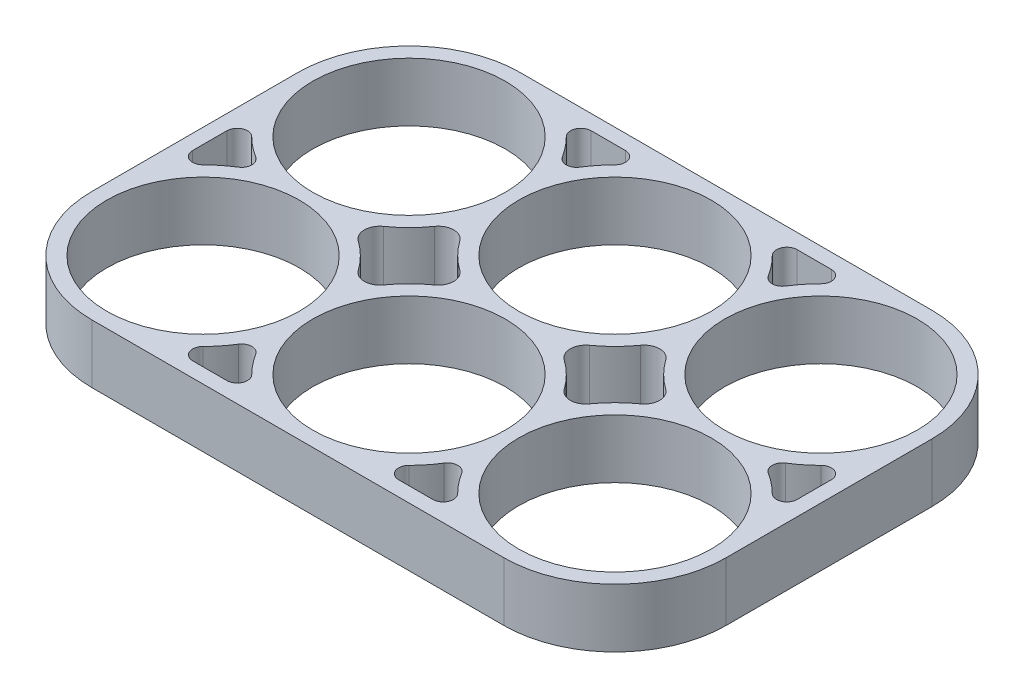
from build123d import *

# Parameters (mm, degrees)
SKIZZE1_R                       = 9.35
AUFSATZ_LINEAR_AUSTRAGEN1_DEPTH = 5.7


with BuildPart() as part:
    # Skizze1 → Aufsatz-Linear austragen1 (new body)
    with BuildSketch(Plane(origin=(0, 0, 0), x_dir=(1, 0, 0), z_dir=(0, 1, 0))):
        with BuildLine():
            Line((-30.8, 10), (-30.8, -10))
            ThreePointArc((-30.8, -10), (-27.636753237, -17.636753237), (-20, -20.8))
            Line((-20, -20.8), (20, -20.8))
            ThreePointArc((20, -20.8), (27.636753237, -17.636753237), (30.8, -10))
            Line((30.8, -10), (30.8, 10))
            ThreePointArc((30.8, 10), (27.636753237, 17.636753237), (20, 20.8))
            Line((20, 20.8), (-20, 20.8))
            ThreePointArc((-20, 20.8), (-27.636753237, 17.636753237), (-30.8, 10))
        make_face()
        with Locations(Location((-20, -10, 0), (0, 0, 270))):
            Circle(SKIZZE1_R, mode=Mode.SUBTRACT)
        with Locations(Location((0, -10, 0), (0, 0, 270))):
            Circle(SKIZZE1_R, mode=Mode.SUBTRACT)
        with Locations(Location((20, -10, 0), (0, 0, 270))):
            Circle(SKIZZE1_R, mode=Mode.SUBTRACT)
        with Locations(Location((20, 10, 0), (0, 0, 270))):
            Circle(SKIZZE1_R, mode=Mode.SUBTRACT)
        with Locations(Location((0, 10, 0), (0, 0, 270))):
            Circle(SKIZZE1_R, mode=Mode.SUBTRACT)
        with Locations(Location((-20, 10, 0), (0, 0, 270))):
            Circle(SKIZZE1_R, mode=Mode.SUBTRACT)
        with BuildLine():
            Line((-29.35, 1.662284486), (-29.35, -1.662284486))
            ThreePointArc((-29.35, -1.662284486), (-28.732343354, -2.58630481), (-27.642372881, -2.368870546))
            ThreePointArc((-27.642372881, -2.368870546), (-26.730970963, -1.554052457), (-25.733320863, -0.847457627))
            ThreePointArc((-25.733320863, -0.847457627), (-25.264183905, 0), (-25.733320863, 0.847457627))
            ThreePointArc((-25.733320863, 0.847457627), (-26.730970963, 1.554052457), (-27.642372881, 2.368870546))
            ThreePointArc((-27.642372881, 2.368870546), (-28.732343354, 2.58630481), (-29.35, 1.662284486))
        make_face(mode=Mode.SUBTRACT)
        with BuildLine():
            Line((-11.662284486, -19.35), (-8.337715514, -19.35))
            ThreePointArc((-8.337715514, -19.35), (-7.41369519, -18.732343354), (-7.631129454, -17.642372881))
            ThreePointArc((-7.631129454, -17.642372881), (-8.445947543, -16.730970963), (-9.152542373, -15.733320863))
            ThreePointArc((-9.152542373, -15.733320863), (-10, -15.264183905), (-10.847457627, -15.733320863))
            ThreePointArc((-10.847457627, -15.733320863), (-11.554052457, -16.730970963), (-12.368870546, -17.642372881))
            ThreePointArc((-12.368870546, -17.642372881), (-12.58630481, -18.732343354), (-11.662284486, -19.35))
        make_face(mode=Mode.SUBTRACT)
        with BuildLine():
            Line((8.337715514, -19.35), (11.662284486, -19.35))
            ThreePointArc((11.662284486, -19.35), (12.58630481, -18.732343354), (12.368870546, -17.642372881))
            ThreePointArc((12.368870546, -17.642372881), (11.554052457, -16.730970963), (10.847457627, -15.733320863))
            ThreePointArc((10.847457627, -15.733320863), (10, -15.264183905), (9.152542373, -15.733320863))
            ThreePointArc((9.152542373, -15.733320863), (8.445947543, -16.730970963), (7.631129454, -17.642372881))
            ThreePointArc((7.631129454, -17.642372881), (7.41369519, -18.732343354), (8.337715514, -19.35))
        make_face(mode=Mode.SUBTRACT)
        with BuildLine():
            Line((29.35, 1.662284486), (29.35, -1.662284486))
            ThreePointArc((29.35, -1.662284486), (28.732343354, -2.58630481), (27.642372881, -2.368870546))
            ThreePointArc((27.642372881, -2.368870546), (26.730970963, -1.554052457), (25.733320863, -0.847457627))
            ThreePointArc((25.733320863, -0.847457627), (25.264183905, 0), (25.733320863, 0.847457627))
            ThreePointArc((25.733320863, 0.847457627), (26.730970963, 1.554052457), (27.642372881, 2.368870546))
            ThreePointArc((27.642372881, 2.368870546), (28.732343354, 2.58630481), (29.35, 1.662284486))
        make_face(mode=Mode.SUBTRACT)
        with BuildLine():
            Line((-11.662284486, 19.35), (-8.337715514, 19.35))
            ThreePointArc((-8.337715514, 19.35), (-7.41369519, 18.732343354), (-7.631129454, 17.642372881))
            ThreePointArc((-7.631129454, 17.642372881), (-8.445947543, 16.730970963), (-9.152542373, 15.733320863))
            ThreePointArc((-9.152542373, 15.733320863), (-10, 15.264183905), (-10.847457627, 15.733320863))
            ThreePointArc((-10.847457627, 15.733320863), (-11.554052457, 16.730970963), (-12.368870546, 17.642372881))
            ThreePointArc((-12.368870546, 17.642372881), (-12.58630481, 18.732343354), (-11.662284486, 19.35))
        make_face(mode=Mode.SUBTRACT)
        with BuildLine():
            Line((8.337715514, 19.35), (11.662284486, 19.35))
            ThreePointArc((11.662284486, 19.35), (12.58630481, 18.732343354), (12.368870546, 17.642372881))
            ThreePointArc((12.368870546, 17.642372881), (11.554052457, 16.730970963), (10.847457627, 15.733320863))
            ThreePointArc((10.847457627, 15.733320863), (10, 15.264183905), (9.152542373, 15.733320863))
            ThreePointArc((9.152542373, 15.733320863), (8.445947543, 16.730970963), (7.631129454, 17.642372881))
            ThreePointArc((7.631129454, 17.642372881), (7.41369519, 18.732343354), (8.337715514, 19.35))
        make_face(mode=Mode.SUBTRACT)
        with BuildLine():
            ThreePointArc((-13.711674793, 1.219512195), (-12.363246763, 2.363246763), (-11.219512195, 3.711674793))
            ThreePointArc((-11.219512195, 3.711674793), (-10, 4.338296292), (-8.780487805, 3.711674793))
            ThreePointArc((-8.780487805, 3.711674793), (-7.636753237, 2.363246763), (-6.288325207, 1.219512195))
            ThreePointArc((-6.288325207, 1.219512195), (-5.661703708, 0), (-6.288325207, -1.219512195))
            ThreePointArc((-6.288325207, -1.219512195), (-7.636753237, -2.363246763), (-8.780487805, -3.711674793))
            ThreePointArc((-8.780487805, -3.711674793), (-10, -4.338296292), (-11.219512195, -3.711674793))
            ThreePointArc((-11.219512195, -3.711674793), (-12.363246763, -2.363246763), (-13.711674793, -1.219512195))
            ThreePointArc((-13.711674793, -1.219512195), (-14.338296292, 0), (-13.711674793, 1.219512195))
        make_face(mode=Mode.SUBTRACT)
        with BuildLine():
            ThreePointArc((6.288325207, 1.219512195), (7.636753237, 2.363246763), (8.780487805, 3.711674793))
            ThreePointArc((8.780487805, 3.711674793), (10, 4.338296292), (11.219512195, 3.711674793))
            ThreePointArc((11.219512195, 3.711674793), (12.363246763, 2.363246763), (13.711674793, 1.219512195))
            ThreePointArc((13.711674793, 1.219512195), (14.338296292, 0), (13.711674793, -1.219512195))
            ThreePointArc((13.711674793, -1.219512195), (12.363246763, -2.363246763), (11.219512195, -3.711674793))
            ThreePointArc((11.219512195, -3.711674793), (10, -4.338296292), (8.780487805, -3.711674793))
            ThreePointArc((8.780487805, -3.711674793), (7.636753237, -2.363246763), (6.288325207, -1.219512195))
            ThreePointArc((6.288325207, -1.219512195), (5.661703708, 0), (6.288325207, 1.219512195))
        make_face(mode=Mode.SUBTRACT)
    extrude(amount=AUFSATZ_LINEAR_AUSTRAGEN1_DEPTH)


solid = part.part
